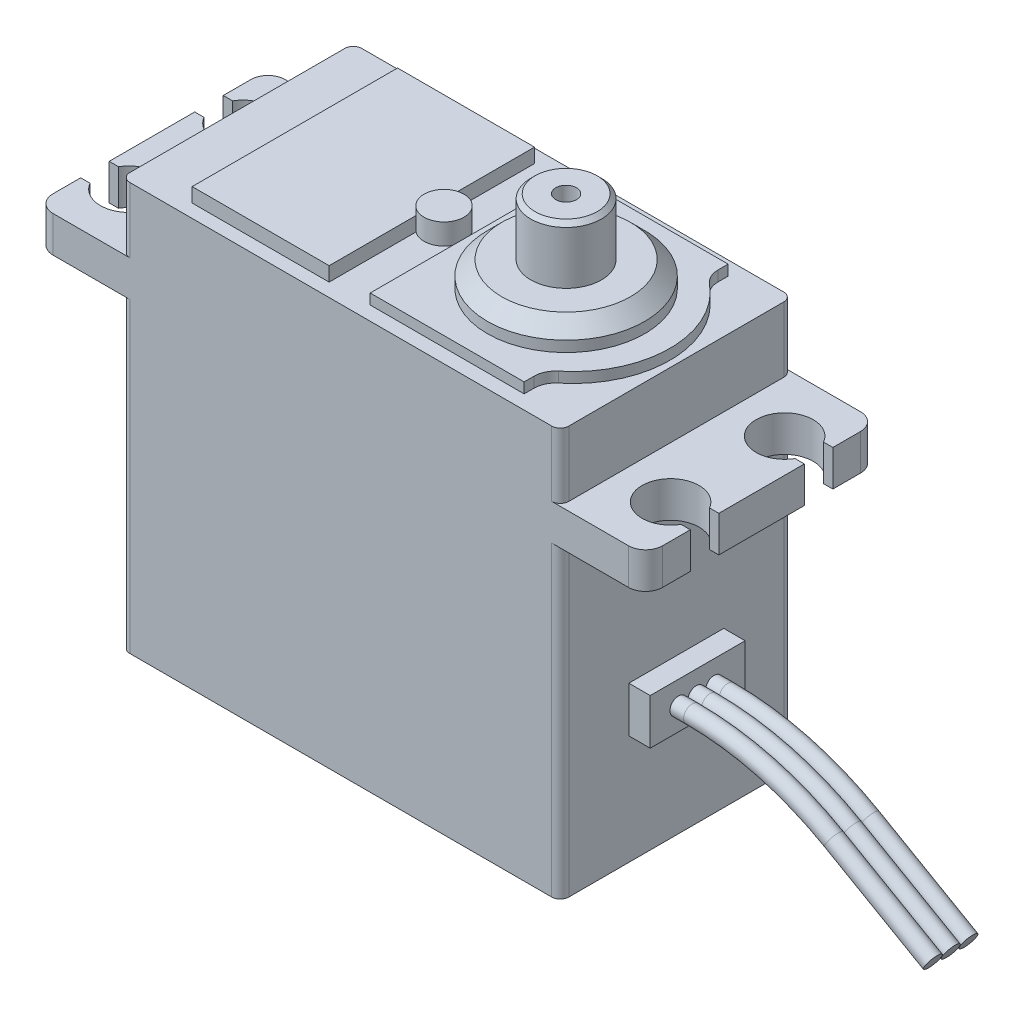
from build123d import *

# Parameters (mm, degrees)
SKETCH1_W           = 30.8
SKETCH1_H           = 16.28
BOSS_EXTRUDE1_DEPTH = 28.62
SKETCH3_W           = 5.985
SKETCH3_H           = 2.53
BOSS_EXTRUDE2_DEPTH = 16.28
SKETCH4_W           = 9.61
SKETCH4_H           = 14.41
BOSS_EXTRUDE3_DEPTH = 1
BOSS_EXTRUDE4_DEPTH = 0.73
SKETCH6_R           = 5.52
BOSS_EXTRUDE5_DEPTH = 1.75
CHAMFER1_SIZE       = 1
FILLET1_R           = 1.5
SKETCH7_R           = 1.4
BOSS_EXTRUDE6_DEPTH = 1.47
SKETCH8_R           = 2.48
BOSS_EXTRUDE7_DEPTH = 4
CUT_EXTRUDE1_DEPTH  = 4
SKETCH10_W          = 6.66
SKETCH10_H          = 3.2
BOSS_EXTRUDE8_DEPTH = 1.5
SKETCH11_R          = 0.6
FILLET2_R           = 1.2
FILLET3_R           = 0.6
CHAMFER2_SIZE       = 0.3
SKETCH13_R          = 0.726441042
CUT_EXTRUDE2_DEPTH  = 2.5


with BuildPart() as part:
    # Sketch1 → Boss-Extrude1 (new body)
    with BuildSketch(Plane(origin=(0, 0, 0), x_dir=(1, 0, 0), z_dir=(0, 1, 0))):
        with Locations((15.4, 8.14)):
            Rectangle(SKETCH1_W, SKETCH1_H)
    extrude(amount=BOSS_EXTRUDE1_DEPTH)

    # Sketch3 → Boss-Extrude2 (add)
    with BuildSketch(Plane.XY):
        with Locations((33.7925, 22.775)):
            Rectangle(SKETCH3_W, SKETCH3_H)
        with Locations((-2.9925, 22.775)):
            Rectangle(SKETCH3_W, SKETCH3_H)
    extrude(amount=-BOSS_EXTRUDE2_DEPTH)

    # Sketch4 → Boss-Extrude3 (add)
    with BuildSketch(Plane(origin=(0, 28.62, 0), x_dir=(1, 0, 0), z_dir=(0, 1, 0))):
        with Locations((8.845, 8.14)):
            Rectangle(SKETCH4_W, SKETCH4_H)
    extrude(amount=BOSS_EXTRUDE3_DEPTH)

    # Sketch5 → Boss-Extrude4 (add)
    with BuildSketch(Plane(origin=(0, 28.62, 0), x_dir=(1, 0, 0), z_dir=(0, 1, 0))):
        with BuildLine():
            Line((27.28, 0.985), (16.48, 0.985))
            Line((16.48, 0.985), (16.48, 15.295))
            Line((16.48, 15.295), (27.28, 15.295))
            Line((27.28, 15.295), (27.28, 13.838504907))
            ThreePointArc((27.28, 13.838504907), (30.36, 8.14), (27.28, 2.441495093))
            Line((27.28, 2.441495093), (27.28, 0.985))
        make_face()
    extrude(amount=BOSS_EXTRUDE4_DEPTH)

    # Sketch6 → Boss-Extrude5 (add)
    with BuildSketch(Plane(origin=(0, 29.35, 0), x_dir=(1, 0, 0), z_dir=(0, 1, 0))):
        with Locations(Location((23.07, 8.14, 0), (0, 0, 270))):
            Circle(SKETCH6_R)
    extrude(amount=BOSS_EXTRUDE5_DEPTH)

    # Chamfer1
    chamfer1_edges = [part.edges().sort_by_distance(p)[0] for p in [
        (23.07, 31.1, -13.66),
    ]]
    chamfer(chamfer1_edges, length=CHAMFER1_SIZE)

    # Fillet1
    fillet1_edges = [part.edges().sort_by_distance(p)[0] for p in [
        (27.28, 28.985, -2.441495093),
        (27.28, 28.985, -13.838504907),
    ]]
    fillet(fillet1_edges, radius=FILLET1_R)

    # Sketch7 → Boss-Extrude6 (add)
    with BuildSketch(Plane(origin=(0, 28.62, 0), x_dir=(1, 0, 0), z_dir=(0, 1, 0))):
        with Locations(Location((14.504271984, 8.14, 0), (0, 0, 127.603551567))):
            Circle(SKETCH7_R)
    extrude(amount=BOSS_EXTRUDE6_DEPTH)

    # Sketch8 → Boss-Extrude7 (add)
    with BuildSketch(Plane(origin=(0, 31.1, 0), x_dir=(1, 0, 0), z_dir=(0, 1, 0))):
        with Locations(Location((23.07, 8.14, 0), (0, 0, 270))):
            Circle(SKETCH8_R)
    extrude(amount=BOSS_EXTRUDE7_DEPTH)

    # Sketch9 → Cut-Extrude1 (cut)
    with BuildSketch(Plane(origin=(0, 24.04, 0), x_dir=(1, 0, 0), z_dir=(0, 1, 0))):
        with BuildLine():
            Line((37.246499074, 13.14), (37.246499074, 11.14))
            Line((37.246499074, 11.14), (36.132050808, 11.14))
            ThreePointArc((36.132050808, 11.14), (32.4, 12.14), (36.132050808, 13.14))
            Line((36.132050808, 13.14), (37.246499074, 13.14))
        make_face()
        with BuildLine():
            Line((36.132050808, 3.14), (37.246499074, 3.14))
            Line((37.246499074, 3.14), (37.246499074, 5.14))
            Line((37.246499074, 5.14), (36.132050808, 5.14))
            ThreePointArc((36.132050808, 5.14), (32.4, 4.14), (36.132050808, 3.14))
        make_face()
        with BuildLine():
            Line((-5.332050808, 5.14), (-6.446499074, 5.14))
            Line((-6.446499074, 5.14), (-6.446499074, 3.14))
            Line((-6.446499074, 3.14), (-5.332050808, 3.14))
            ThreePointArc((-5.332050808, 3.14), (-1.6, 4.14), (-5.332050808, 5.14))
        make_face()
        with BuildLine():
            Line((-5.332050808, 13.14), (-6.446499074, 13.14))
            Line((-6.446499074, 13.14), (-6.446499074, 11.14))
            Line((-6.446499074, 11.14), (-5.332050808, 11.14))
            ThreePointArc((-5.332050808, 11.14), (-1.6, 12.14), (-5.332050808, 13.14))
        make_face()
    extrude(amount=-CUT_EXTRUDE1_DEPTH, mode=Mode.SUBTRACT)

    # Sketch10 → Boss-Extrude8 (add)
    with BuildSketch(Plane(origin=(30.8, 0, 0), x_dir=(0, 0, -1), z_dir=(1, 0, 0))):
        with Locations((8.14, 9.29)):
            Rectangle(SKETCH10_W, SKETCH10_H)
    extrude(amount=BOSS_EXTRUDE8_DEPTH)

    # Sweep1: sweep along a path in Sketch12
    with BuildLine(Plane(origin=(0, 0, -8.14), x_dir=(-1, 0, 0), z_dir=(0, 0, -1))) as sweep1_path:
        Line((-32.3, 9.27453939), (-33.261270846, 9.27453939))
        ThreePointArc((-33.261270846, 9.27453939), (-38.407623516, 8.601076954), (-43.207388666, 6.626044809))
        Line((-43.207388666, 6.626044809), (-50.146426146, 2.648494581))
    # Sketch11 → Sweep1 (sweep)
    with BuildSketch(Plane(origin=(32.3, 0, 0), x_dir=(0, 0, -1), z_dir=(1, 0, 0))):
        with Locations((6.7940488, 9.27453939)):
            Circle(SKETCH11_R)
        with Locations((8.045254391, 9.27453939)):
            Circle(SKETCH11_R)
        with Locations((9.289971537, 9.27453939)):
            Circle(SKETCH11_R)
    sweep(path=sweep1_path.line)

    # Fillet2
    fillet2_edges = [part.edges().sort_by_distance(p)[0] for p in [
        (-5.985, 22.775, 0),
        (-5.985, 22.775, -16.28),
        (36.785, 22.775, 0),
        (36.785, 22.775, -16.28),
    ]]
    fillet(fillet2_edges, radius=FILLET2_R)

    # Fillet3
    fillet3_edges = [part.edges().sort_by_distance(p)[0] for p in [
        (0, 26.33, 0),
        (0, 10.755, 0),
        (30.8, 10.755, 0),
        (0, 10.755, -16.28),
        (0, 26.33, -16.28),
        (30.8, 26.33, 0),
        (30.8, 26.33, -16.28),
        (30.8, 10.755, -16.28),
    ]]
    fillet(fillet3_edges, radius=FILLET3_R)

    # Chamfer2
    chamfer2_edges = [part.edges().sort_by_distance(p)[0] for p in [
        (23.07, 35.1, -10.62),
    ]]
    chamfer(chamfer2_edges, length=CHAMFER2_SIZE)

    # Sketch13 → Cut-Extrude2 (cut)
    with BuildSketch(Plane(origin=(0, 35.1, 0), x_dir=(1, 0, 0), z_dir=(0, 1, 0))):
        with Locations(Location((23.07, 8.14, 0), (0, 0, 270))):
            Circle(SKETCH13_R)
    extrude(amount=-CUT_EXTRUDE2_DEPTH, mode=Mode.SUBTRACT)


solid = part.part
